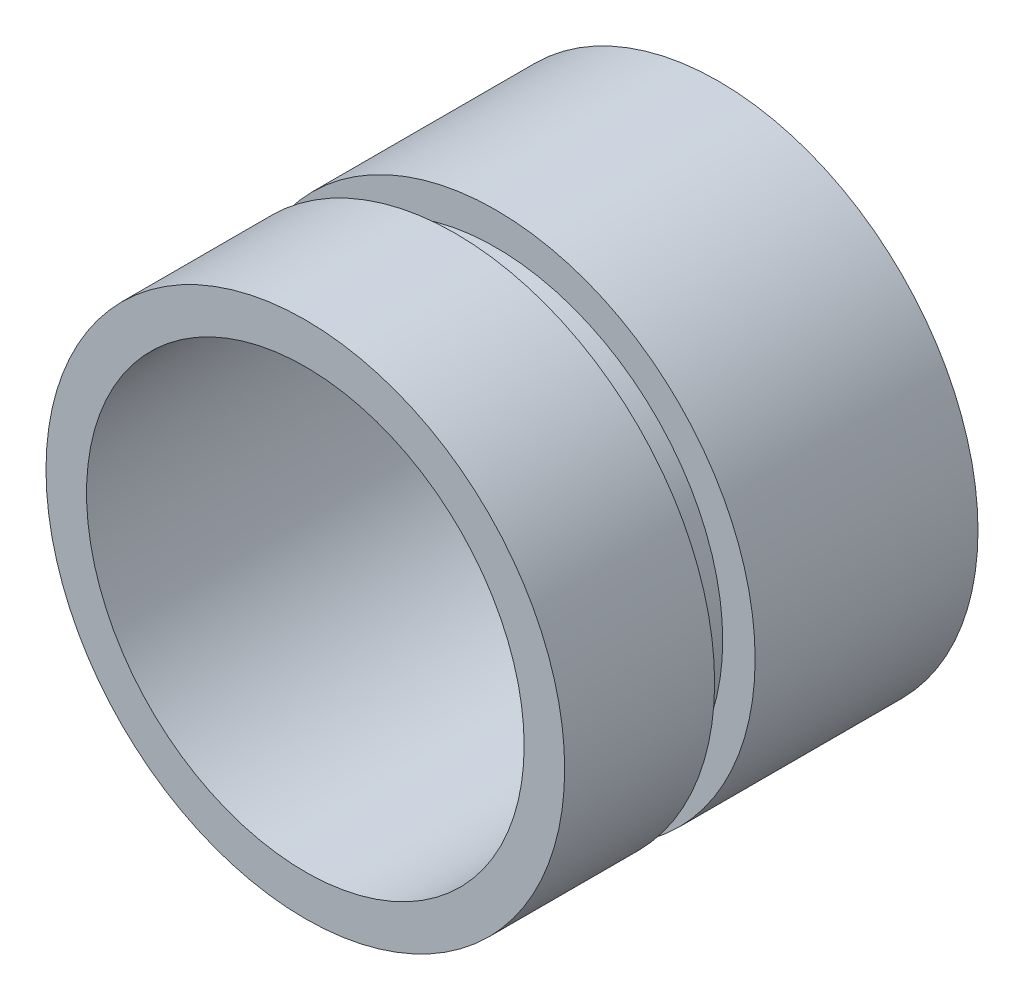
ISO-10303-21;
HEADER;
FILE_DESCRIPTION(('STEP AP214'),'2;1');
FILE_NAME('part.step','',(''),(''),'','','');
FILE_SCHEMA(('AUTOMOTIVE_DESIGN { 1 0 10303 214 1 1 1 1 }'));
ENDSEC;
DATA;
#1=APPLICATION_CONTEXT('core data for automotive mechanical design processes');
#2=APPLICATION_PROTOCOL_DEFINITION('international standard','automotive_design',2000,#1);
#3=PRODUCT_CONTEXT('',#1,'mechanical');
#4=PRODUCT('Part','Part','',(#3));
#5=PRODUCT_RELATED_PRODUCT_CATEGORY('part','',(#4));
#6=PRODUCT_DEFINITION_FORMATION('','',#4);
#7=PRODUCT_DEFINITION_CONTEXT('part definition',#1,'design');
#8=PRODUCT_DEFINITION('design','',#6,#7);
#9=PRODUCT_DEFINITION_SHAPE('','',#8);
#10=(LENGTH_UNIT() NAMED_UNIT(*) SI_UNIT(.MILLI.,.METRE.));
#11=(NAMED_UNIT(*) PLANE_ANGLE_UNIT() SI_UNIT($,.RADIAN.));
#12=(NAMED_UNIT(*) SI_UNIT($,.STERADIAN.) SOLID_ANGLE_UNIT());
#13=UNCERTAINTY_MEASURE_WITH_UNIT(LENGTH_MEASURE(1.E-05),#10,'distance_accuracy_value','');
#14=(GEOMETRIC_REPRESENTATION_CONTEXT(3) GLOBAL_UNCERTAINTY_ASSIGNED_CONTEXT((#13)) GLOBAL_UNIT_ASSIGNED_CONTEXT((#10,
#11,#12)) REPRESENTATION_CONTEXT('',''));
#15=CARTESIAN_POINT('',(0.,0.,0.));
#16=DIRECTION('',(0.,0.,1.));
#17=DIRECTION('',(1.,0.,0.));
#18=AXIS2_PLACEMENT_3D('',#15,#16,#17);
#19=CARTESIAN_POINT('',(0.,0.,25.5));
#20=DIRECTION('',(0.,0.,-1.));
#21=DIRECTION('',(-1.,0.,0.));
#22=AXIS2_PLACEMENT_3D('',#19,#20,#21);
#23=CYLINDRICAL_SURFACE('',#22,16.);
#24=CARTESIAN_POINT('',(0.,0.,25.5));
#25=DIRECTION('',(0.,0.,1.));
#26=DIRECTION('',(1.,0.,0.));
#27=AXIS2_PLACEMENT_3D('',#24,#25,#26);
#28=CIRCLE('',#27,16.);
#29=CARTESIAN_POINT('',(16.,0.,25.5));
#30=VERTEX_POINT('',#29);
#31=EDGE_CURVE('E10',#30,#30,#28,.T.);
#32=ORIENTED_EDGE('',*,*,#31,.F.);
#33=EDGE_LOOP('',(#32));
#34=FACE_BOUND('',#33,.T.);
#35=CARTESIAN_POINT('',(0.,0.,16.25));
#36=DIRECTION('',(0.,0.,-1.));
#37=DIRECTION('',(-1.,0.,0.));
#38=AXIS2_PLACEMENT_3D('',#35,#36,#37);
#39=CIRCLE('',#38,16.);
#40=CARTESIAN_POINT('',(-16.,0.,16.25));
#41=VERTEX_POINT('',#40);
#42=EDGE_CURVE('E30',#41,#41,#39,.T.);
#43=ORIENTED_EDGE('',*,*,#42,.F.);
#44=EDGE_LOOP('',(#43));
#45=FACE_BOUND('',#44,.T.);
#46=ADVANCED_FACE('F27',(#34,#45),#23,.T.);
#47=CARTESIAN_POINT('',(0.,0.,0.));
#48=DIRECTION('',(0.,0.,1.));
#49=DIRECTION('',(1.,0.,0.));
#50=AXIS2_PLACEMENT_3D('',#47,#48,#49);
#51=CIRCLE('',#50,16.);
#52=CARTESIAN_POINT('',(16.,0.,0.));
#53=VERTEX_POINT('',#52);
#54=EDGE_CURVE('E34',#53,#53,#51,.T.);
#55=ORIENTED_EDGE('',*,*,#54,.T.);
#56=EDGE_LOOP('',(#55));
#57=FACE_BOUND('',#56,.T.);
#58=CARTESIAN_POINT('',(0.,0.,13.75));
#59=DIRECTION('',(0.,0.,1.));
#60=DIRECTION('',(1.,0.,0.));
#61=AXIS2_PLACEMENT_3D('',#58,#59,#60);
#62=CIRCLE('',#61,16.);
#63=CARTESIAN_POINT('',(16.,0.,13.75));
#64=VERTEX_POINT('',#63);
#65=EDGE_CURVE('E42',#64,#64,#62,.T.);
#66=ORIENTED_EDGE('',*,*,#65,.F.);
#67=EDGE_LOOP('',(#66));
#68=FACE_BOUND('',#67,.T.);
#69=ADVANCED_FACE('F67',(#57,#68),#23,.T.);
#70=CARTESIAN_POINT('',(0.,0.,25.5));
#71=DIRECTION('',(0.,0.,1.));
#72=DIRECTION('',(1.,0.,0.));
#73=AXIS2_PLACEMENT_3D('',#70,#71,#72);
#74=PLANE('',#73);
#75=ORIENTED_EDGE('',*,*,#31,.T.);
#76=EDGE_LOOP('',(#75));
#77=FACE_BOUND('',#76,.T.);
#78=CARTESIAN_POINT('',(0.,0.,25.5));
#79=DIRECTION('',(0.,0.,1.));
#80=DIRECTION('',(1.,0.,0.));
#81=AXIS2_PLACEMENT_3D('',#78,#79,#80);
#82=CIRCLE('',#81,13.5);
#83=CARTESIAN_POINT('',(13.5,0.,25.5));
#84=VERTEX_POINT('',#83);
#85=EDGE_CURVE('E39',#84,#84,#82,.T.);
#86=ORIENTED_EDGE('',*,*,#85,.F.);
#87=EDGE_LOOP('',(#86));
#88=FACE_BOUND('',#87,.T.);
#89=ADVANCED_FACE('F64',(#77,#88),#74,.T.);
#90=CARTESIAN_POINT('',(0.,0.,0.));
#91=DIRECTION('',(0.,0.,1.));
#92=DIRECTION('',(1.,0.,0.));
#93=AXIS2_PLACEMENT_3D('',#90,#91,#92);
#94=PLANE('',#93);
#95=ORIENTED_EDGE('',*,*,#54,.F.);
#96=EDGE_LOOP('',(#95));
#97=FACE_BOUND('',#96,.T.);
#98=CARTESIAN_POINT('',(0.,0.,0.));
#99=DIRECTION('',(0.,0.,1.));
#100=DIRECTION('',(1.,0.,0.));
#101=AXIS2_PLACEMENT_3D('',#98,#99,#100);
#102=CIRCLE('',#101,13.5);
#103=CARTESIAN_POINT('',(13.5,0.,0.));
#104=VERTEX_POINT('',#103);
#105=EDGE_CURVE('E48',#104,#104,#102,.T.);
#106=ORIENTED_EDGE('',*,*,#105,.T.);
#107=EDGE_LOOP('',(#106));
#108=FACE_BOUND('',#107,.T.);
#109=ADVANCED_FACE('F66',(#97,#108),#94,.F.);
#110=CARTESIAN_POINT('',(0.,0.,25.5));
#111=DIRECTION('',(0.,0.,-1.));
#112=DIRECTION('',(-1.,0.,0.));
#113=AXIS2_PLACEMENT_3D('',#110,#111,#112);
#114=CYLINDRICAL_SURFACE('',#113,13.5);
#115=ORIENTED_EDGE('',*,*,#85,.T.);
#116=EDGE_LOOP('',(#115));
#117=FACE_BOUND('',#116,.T.);
#118=ORIENTED_EDGE('',*,*,#105,.F.);
#119=EDGE_LOOP('',(#118));
#120=FACE_BOUND('',#119,.T.);
#121=ADVANCED_FACE('F61',(#117,#120),#114,.F.);
#122=CARTESIAN_POINT('',(0.,16.8732333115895,16.25));
#123=DIRECTION('',(0.,0.,-1.));
#124=DIRECTION('',(-1.,0.,0.));
#125=AXIS2_PLACEMENT_3D('',#122,#123,#124);
#126=PLANE('',#125);
#127=CARTESIAN_POINT('',(0.,0.,16.25));
#128=DIRECTION('',(0.,0.,1.));
#129=DIRECTION('',(1.,0.,0.));
#130=AXIS2_PLACEMENT_3D('',#127,#128,#129);
#131=CIRCLE('',#130,14.);
#132=CARTESIAN_POINT('',(14.,0.,16.25));
#133=VERTEX_POINT('',#132);
#134=EDGE_CURVE('E44',#133,#133,#131,.T.);
#135=ORIENTED_EDGE('',*,*,#134,.T.);
#136=EDGE_LOOP('',(#135));
#137=FACE_BOUND('',#136,.T.);
#138=ORIENTED_EDGE('',*,*,#42,.T.);
#139=EDGE_LOOP('',(#138));
#140=FACE_BOUND('',#139,.T.);
#141=ADVANCED_FACE('F82',(#137,#140),#126,.T.);
#142=CARTESIAN_POINT('',(0.,16.8732333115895,13.75));
#143=DIRECTION('',(0.,0.,1.));
#144=DIRECTION('',(1.,0.,0.));
#145=AXIS2_PLACEMENT_3D('',#142,#143,#144);
#146=PLANE('',#145);
#147=CARTESIAN_POINT('',(0.,0.,13.75));
#148=DIRECTION('',(0.,0.,1.));
#149=DIRECTION('',(1.,0.,0.));
#150=AXIS2_PLACEMENT_3D('',#147,#148,#149);
#151=CIRCLE('',#150,14.);
#152=CARTESIAN_POINT('',(14.,0.,13.75));
#153=VERTEX_POINT('',#152);
#154=EDGE_CURVE('E50',#153,#153,#151,.T.);
#155=ORIENTED_EDGE('',*,*,#154,.F.);
#156=EDGE_LOOP('',(#155));
#157=FACE_BOUND('',#156,.T.);
#158=ORIENTED_EDGE('',*,*,#65,.T.);
#159=EDGE_LOOP('',(#158));
#160=FACE_BOUND('',#159,.T.);
#161=ADVANCED_FACE('F84',(#157,#160),#146,.T.);
#162=CARTESIAN_POINT('',(0.,0.,27.6401935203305));
#163=DIRECTION('',(0.,0.,1.));
#164=DIRECTION('',(1.,0.,0.));
#165=AXIS2_PLACEMENT_3D('',#162,#163,#164);
#166=CYLINDRICAL_SURFACE('',#165,14.);
#167=ORIENTED_EDGE('',*,*,#154,.T.);
#168=EDGE_LOOP('',(#167));
#169=FACE_BOUND('',#168,.T.);
#170=ORIENTED_EDGE('',*,*,#134,.F.);
#171=EDGE_LOOP('',(#170));
#172=FACE_BOUND('',#171,.T.);
#173=ADVANCED_FACE('F90',(#169,#172),#166,.T.);
#174=CLOSED_SHELL('',(#46,#69,#89,#109,#121,#141,#161,#173));
#175=MANIFOLD_SOLID_BREP('B2',#174);
#176=ADVANCED_BREP_SHAPE_REPRESENTATION('',(#18,#175),#14);
#177=SHAPE_DEFINITION_REPRESENTATION(#9,#176);
ENDSEC;
END-ISO-10303-21;
